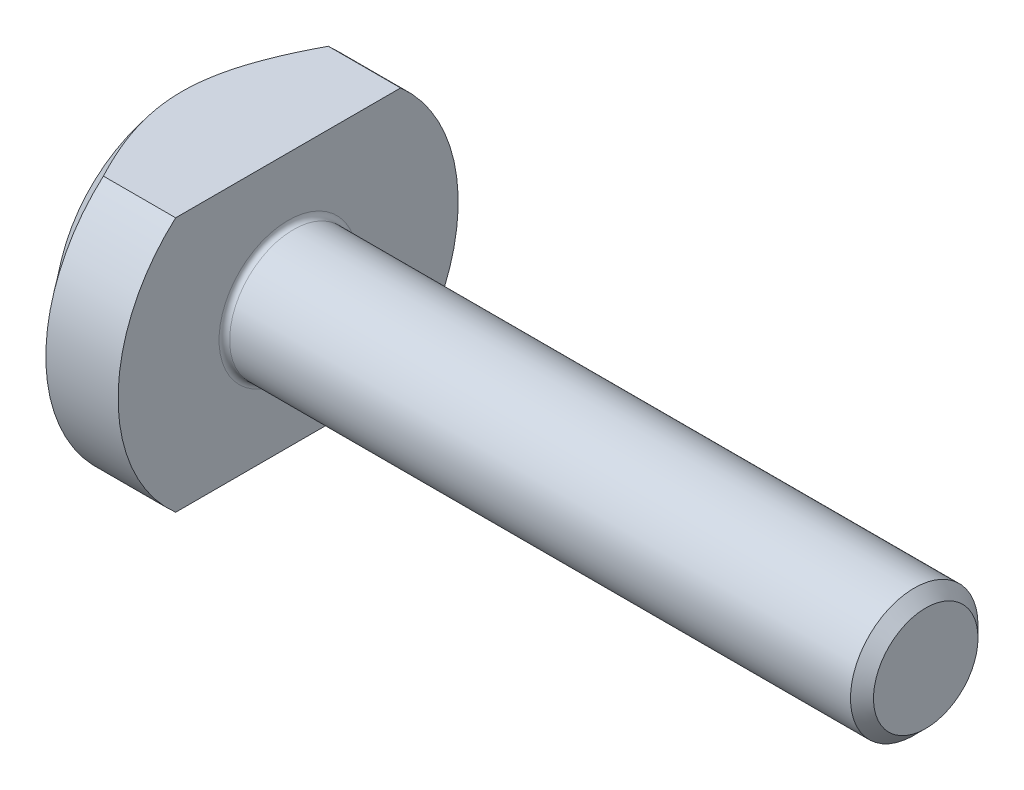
ISO-10303-21;
HEADER;
FILE_DESCRIPTION(('STEP AP214'),'2;1');
FILE_NAME('part.step','',(''),(''),'','','');
FILE_SCHEMA(('AUTOMOTIVE_DESIGN { 1 0 10303 214 1 1 1 1 }'));
ENDSEC;
DATA;
#1=APPLICATION_CONTEXT('core data for automotive mechanical design processes');
#2=APPLICATION_PROTOCOL_DEFINITION('international standard','automotive_design',2000,#1);
#3=PRODUCT_CONTEXT('',#1,'mechanical');
#4=PRODUCT('Part','Part','',(#3));
#5=PRODUCT_RELATED_PRODUCT_CATEGORY('part','',(#4));
#6=PRODUCT_DEFINITION_FORMATION('','',#4);
#7=PRODUCT_DEFINITION_CONTEXT('part definition',#1,'design');
#8=PRODUCT_DEFINITION('design','',#6,#7);
#9=PRODUCT_DEFINITION_SHAPE('','',#8);
#10=(LENGTH_UNIT() NAMED_UNIT(*) SI_UNIT(.MILLI.,.METRE.));
#11=(NAMED_UNIT(*) PLANE_ANGLE_UNIT() SI_UNIT($,.RADIAN.));
#12=(NAMED_UNIT(*) SI_UNIT($,.STERADIAN.) SOLID_ANGLE_UNIT());
#13=UNCERTAINTY_MEASURE_WITH_UNIT(LENGTH_MEASURE(1.E-05),#10,'distance_accuracy_value','');
#14=(GEOMETRIC_REPRESENTATION_CONTEXT(3) GLOBAL_UNCERTAINTY_ASSIGNED_CONTEXT((#13)) GLOBAL_UNIT_ASSIGNED_CONTEXT((#10,
#11,#12)) REPRESENTATION_CONTEXT('',''));
#15=CARTESIAN_POINT('',(0.,0.,0.));
#16=DIRECTION('',(0.,0.,1.));
#17=DIRECTION('',(1.,0.,0.));
#18=AXIS2_PLACEMENT_3D('',#15,#16,#17);
#19=CARTESIAN_POINT('',(0.,0.,0.));
#20=DIRECTION('',(1.,0.,0.));
#21=DIRECTION('',(0.,0.,-1.));
#22=AXIS2_PLACEMENT_3D('',#19,#20,#21);
#23=PLANE('',#22);
#24=CARTESIAN_POINT('',(0.,0.,0.));
#25=DIRECTION('',(1.,0.,0.));
#26=DIRECTION('',(0.,0.,-1.));
#27=AXIS2_PLACEMENT_3D('',#24,#25,#26);
#28=CIRCLE('',#27,3.25);
#29=CARTESIAN_POINT('',(0.,0.,-3.25));
#30=VERTEX_POINT('',#29);
#31=EDGE_CURVE('E153',#30,#30,#28,.F.);
#32=ORIENTED_EDGE('',*,*,#31,.T.);
#33=EDGE_LOOP('',(#32));
#34=FACE_BOUND('',#33,.T.);
#35=DIRECTION('',(0.,0.,1.));
#36=VECTOR('',#35,1.);
#37=CARTESIAN_POINT('',(0.,-6.,-5.29150262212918));
#38=LINE('',#37,#36);
#39=CARTESIAN_POINT('',(0.,-6.,-5.29150262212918));
#40=VERTEX_POINT('',#39);
#41=CARTESIAN_POINT('',(0.,-6.,5.29150262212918));
#42=VERTEX_POINT('',#41);
#43=EDGE_CURVE('E80',#40,#42,#38,.T.);
#44=ORIENTED_EDGE('',*,*,#43,.F.);
#45=CARTESIAN_POINT('',(0.,0.,0.));
#46=DIRECTION('',(-1.,0.,0.));
#47=DIRECTION('',(0.,0.,1.));
#48=AXIS2_PLACEMENT_3D('',#45,#46,#47);
#49=CIRCLE('',#48,8.);
#50=CARTESIAN_POINT('',(0.,6.,-5.29150262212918));
#51=VERTEX_POINT('',#50);
#52=EDGE_CURVE('E91',#51,#40,#49,.T.);
#53=ORIENTED_EDGE('',*,*,#52,.F.);
#54=DIRECTION('',(0.,0.,-1.));
#55=VECTOR('',#54,1.);
#56=CARTESIAN_POINT('',(0.,6.,-5.29150262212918));
#57=LINE('',#56,#55);
#58=CARTESIAN_POINT('',(0.,6.,5.29150262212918));
#59=VERTEX_POINT('',#58);
#60=EDGE_CURVE('E235',#59,#51,#57,.T.);
#61=ORIENTED_EDGE('',*,*,#60,.F.);
#62=EDGE_CURVE('E92',#42,#59,#49,.T.);
#63=ORIENTED_EDGE('',*,*,#62,.F.);
#64=EDGE_LOOP('',(#44,#53,#61,#63));
#65=FACE_BOUND('',#64,.T.);
#66=ADVANCED_FACE('F37',(#34,#65),#23,.T.);
#67=CARTESIAN_POINT('',(-7.3913010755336,0.,0.));
#68=DIRECTION('',(-1.,0.,0.));
#69=DIRECTION('',(0.,0.,1.));
#70=AXIS2_PLACEMENT_3D('',#67,#68,#69);
#71=CYLINDRICAL_SURFACE('',#70,8.);
#72=DIRECTION('',(1.,0.,0.));
#73=VECTOR('',#72,1.);
#74=CARTESIAN_POINT('',(-5.24,-6.,-5.29150262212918));
#75=LINE('',#74,#73);
#76=CARTESIAN_POINT('',(-3.4,-6.,-5.29150262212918));
#77=VERTEX_POINT('',#76);
#78=EDGE_CURVE('E77',#77,#40,#75,.T.);
#79=ORIENTED_EDGE('',*,*,#78,.F.);
#80=CARTESIAN_POINT('',(-3.4,0.,0.));
#81=DIRECTION('',(-1.,0.,0.));
#82=DIRECTION('',(0.,0.,1.));
#83=AXIS2_PLACEMENT_3D('',#80,#81,#82);
#84=CIRCLE('',#83,8.);
#85=CARTESIAN_POINT('',(-3.4,6.,-5.29150262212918));
#86=VERTEX_POINT('',#85);
#87=EDGE_CURVE('E98',#86,#77,#84,.T.);
#88=ORIENTED_EDGE('',*,*,#87,.F.);
#89=DIRECTION('',(1.,0.,0.));
#90=VECTOR('',#89,1.);
#91=CARTESIAN_POINT('',(-5.24,6.,-5.29150262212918));
#92=LINE('',#91,#90);
#93=EDGE_CURVE('E60',#86,#51,#92,.T.);
#94=ORIENTED_EDGE('',*,*,#93,.T.);
#95=ORIENTED_EDGE('',*,*,#52,.T.);
#96=EDGE_LOOP('',(#79,#88,#94,#95));
#97=FACE_BOUND('',#96,.T.);
#98=ADVANCED_FACE('F94',(#97),#71,.T.);
#99=DIRECTION('',(1.,0.,0.));
#100=VECTOR('',#99,1.);
#101=CARTESIAN_POINT('',(-5.24,-6.,5.29150262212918));
#102=LINE('',#101,#100);
#103=CARTESIAN_POINT('',(-3.4,-6.,5.29150262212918));
#104=VERTEX_POINT('',#103);
#105=EDGE_CURVE('E52',#104,#42,#102,.T.);
#106=ORIENTED_EDGE('',*,*,#105,.T.);
#107=ORIENTED_EDGE('',*,*,#62,.T.);
#108=DIRECTION('',(1.,0.,0.));
#109=VECTOR('',#108,1.);
#110=CARTESIAN_POINT('',(-5.24,6.,5.29150262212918));
#111=LINE('',#110,#109);
#112=CARTESIAN_POINT('',(-3.4,6.,5.29150262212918));
#113=VERTEX_POINT('',#112);
#114=EDGE_CURVE('E237',#113,#59,#111,.T.);
#115=ORIENTED_EDGE('',*,*,#114,.F.);
#116=EDGE_CURVE('E234',#104,#113,#84,.T.);
#117=ORIENTED_EDGE('',*,*,#116,.F.);
#118=EDGE_LOOP('',(#106,#107,#115,#117));
#119=FACE_BOUND('',#118,.T.);
#120=ADVANCED_FACE('F129',(#119),#71,.T.);
#121=CARTESIAN_POINT('',(-5.24,0.,0.));
#122=DIRECTION('',(1.,0.,0.));
#123=DIRECTION('',(0.,0.,-1.));
#124=AXIS2_PLACEMENT_3D('',#121,#122,#123);
#125=CONICAL_SURFACE('',#124,5.7,0.896055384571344);
#126=CARTESIAN_POINT('',(0.0812122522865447,-6.,-10.7962924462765));
#127=CARTESIAN_POINT('',(-0.103712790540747,-6.,-10.5317885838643));
#128=CARTESIAN_POINT('',(-0.287608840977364,-6.,-10.2665569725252));
#129=CARTESIAN_POINT('',(-0.652787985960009,-6.,-9.7342551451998));
#130=CARTESIAN_POINT('',(-0.834070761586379,-6.,-9.46718471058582));
#131=CARTESIAN_POINT('',(-1.19435262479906,-6.,-8.92949912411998));
#132=CARTESIAN_POINT('',(-1.37333505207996,-6.,-8.65887278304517));
#133=CARTESIAN_POINT('',(-1.72721903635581,-6.,-8.1149775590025));
#134=CARTESIAN_POINT('',(-1.90212078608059,-6.,-7.84170880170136));
#135=CARTESIAN_POINT('',(-2.26127215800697,-6.,-7.26876847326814));
#136=CARTESIAN_POINT('',(-2.44506841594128,-6.,-6.96881161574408));
#137=CARTESIAN_POINT('',(-2.80467537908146,-6.,-6.36405737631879));
#138=CARTESIAN_POINT('',(-2.98048486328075,-6.,-6.0592592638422));
#139=CARTESIAN_POINT('',(-3.32092753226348,-6.,-5.44430216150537));
#140=CARTESIAN_POINT('',(-3.48558379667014,-6.,-5.13415601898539));
#141=CARTESIAN_POINT('',(-3.80009577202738,-6.,-4.50645532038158));
#142=CARTESIAN_POINT('',(-3.94995698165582,-6.,-4.18890357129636));
#143=CARTESIAN_POINT('',(-4.14434586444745,-6.,-3.7403243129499));
#144=CARTESIAN_POINT('',(-4.19759942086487,-6.,-3.61306616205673));
#145=CARTESIAN_POINT('',(-4.3004539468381,-6.,-3.35709558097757));
#146=CARTESIAN_POINT('',(-4.3500553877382,-6.,-3.22838334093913));
#147=CARTESIAN_POINT('',(-4.44511852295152,-6.,-2.96943216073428));
#148=CARTESIAN_POINT('',(-4.49058029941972,-6.,-2.83919325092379));
#149=CARTESIAN_POINT('',(-4.57683375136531,-6.,-2.57712566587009));
#150=CARTESIAN_POINT('',(-4.61762337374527,-6.,-2.44529631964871));
#151=CARTESIAN_POINT('',(-4.73039488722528,-6.,-2.05331680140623));
#152=CARTESIAN_POINT('',(-4.79493769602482,-6.,-1.79092206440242));
#153=CARTESIAN_POINT('',(-4.87326205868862,-6.,-1.39379350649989));
#154=CARTESIAN_POINT('',(-4.89628744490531,-6.,-1.26083859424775));
#155=CARTESIAN_POINT('',(-4.93571247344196,-6.,-0.993956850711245));
#156=CARTESIAN_POINT('',(-4.95211322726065,-6.,-0.860030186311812));
#157=CARTESIAN_POINT('',(-4.97813018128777,-6.,-0.589213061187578));
#158=CARTESIAN_POINT('',(-4.98762602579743,-6.,-0.452310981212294));
#159=CARTESIAN_POINT('',(-4.99913128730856,-6.,-0.178208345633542));
#160=CARTESIAN_POINT('',(-5.0011417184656,-6.,-0.0410078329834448));
#161=CARTESIAN_POINT('',(-4.99762585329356,-6.,0.233297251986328));
#162=CARTESIAN_POINT('',(-4.99209948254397,-6.,0.370401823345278));
#163=CARTESIAN_POINT('',(-4.97365347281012,-6.,0.644114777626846));
#164=CARTESIAN_POINT('',(-4.96073348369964,-6.,0.780723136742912));
#165=CARTESIAN_POINT('',(-4.92747126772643,-6.,1.05595700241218));
#166=CARTESIAN_POINT('',(-4.90697806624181,-6.,1.19456418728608));
#167=CARTESIAN_POINT('',(-4.85910314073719,-6.,1.47059259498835));
#168=CARTESIAN_POINT('',(-4.83172025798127,-6.,1.60801361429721));
#169=CARTESIAN_POINT('',(-4.74010210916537,-6.,2.01813546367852));
#170=CARTESIAN_POINT('',(-4.6663911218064,-6.,2.28874355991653));
#171=CARTESIAN_POINT('',(-4.4906748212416,-6.,2.84923616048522));
#172=CARTESIAN_POINT('',(-4.38662663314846,-6.,3.13846347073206));
#173=CARTESIAN_POINT('',(-4.16011981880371,-6.,3.70971306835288));
#174=CARTESIAN_POINT('',(-4.0376495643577,-6.,3.99173067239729));
#175=CARTESIAN_POINT('',(-3.77850411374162,-6.,4.55035581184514));
#176=CARTESIAN_POINT('',(-3.64177801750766,-6.,4.82693945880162));
#177=CARTESIAN_POINT('',(-3.35798319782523,-6.,5.37462425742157));
#178=CARTESIAN_POINT('',(-3.21091687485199,-6.,5.6457266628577));
#179=CARTESIAN_POINT('',(-2.91774131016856,-6.,6.16774113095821));
#180=CARTESIAN_POINT('',(-2.77207985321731,-6.,6.41890621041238));
#181=CARTESIAN_POINT('',(-2.47526982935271,-6.,6.91798875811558));
#182=CARTESIAN_POINT('',(-2.32412083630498,-6.,7.1659059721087));
#183=CARTESIAN_POINT('',(-2.01891852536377,-6.,7.65673552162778));
#184=CARTESIAN_POINT('',(-1.86490545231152,-6.,7.89967297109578));
#185=CARTESIAN_POINT('',(-1.55344783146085,-6.,8.38325955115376));
#186=CARTESIAN_POINT('',(-1.39600410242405,-6.,8.62390920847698));
#187=CARTESIAN_POINT('',(-1.23721967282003,-6.,8.8636553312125));
#188=B_SPLINE_CURVE_WITH_KNOTS('',3,(#126,#127,#128,#129,#130,#131,#132,#133,#134,#135,#136,
#137,#138,#139,#140,#141,#142,#143,#144,#145,#146,#147,#148,#149,#150,#151,#152,#153,#154,#155,
#156,#157,#158,#159,#160,#161,#162,#163,#164,#165,#166,#167,#168,#169,#170,#171,#172,#173,#174,
#175,#176,#177,#178,#179,#180,#181,#182,#183,#184,#185,#186,#187),.UNSPECIFIED.,.F.,.F.,(4,2,2,
2,2,2,2,2,2,2,2,2,2,2,2,2,2,2,2,2,2,2,2,2,2,2,2,2,2,2,4),(0.,0.968220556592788,1.93655828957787,
2.90990422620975,3.88320409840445,4.93847831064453,5.99391331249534,7.04709297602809,
8.09987973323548,8.51368870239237,8.9274441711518,9.34119142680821,9.75511980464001,
10.5645848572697,10.9692532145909,11.37385364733,11.7853476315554,12.1967858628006,
12.6082281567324,13.0196899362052,13.4398405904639,13.8600619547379,14.7003586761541,
15.6216776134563,16.5435805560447,17.4688958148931,18.3939969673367,19.2649525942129,
20.1359760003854,20.9988742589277,21.8615687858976),.UNSPECIFIED.);
#189=EDGE_CURVE('E81',#104,#77,#188,.F.);
#190=ORIENTED_EDGE('',*,*,#189,.F.);
#191=ORIENTED_EDGE('',*,*,#116,.T.);
#192=CARTESIAN_POINT('',(0.0812122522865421,6.,-10.7962924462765));
#193=CARTESIAN_POINT('',(-0.103712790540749,6.,-10.5317885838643));
#194=CARTESIAN_POINT('',(-0.287608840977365,6.,-10.2665569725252));
#195=CARTESIAN_POINT('',(-0.652787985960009,6.,-9.7342551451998));
#196=CARTESIAN_POINT('',(-0.834070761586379,6.,-9.46718471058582));
#197=CARTESIAN_POINT('',(-1.19435262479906,6.,-8.92949912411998));
#198=CARTESIAN_POINT('',(-1.37333505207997,6.,-8.65887278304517));
#199=CARTESIAN_POINT('',(-1.72721903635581,6.,-8.11497755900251));
#200=CARTESIAN_POINT('',(-1.90212078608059,6.,-7.84170880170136));
#201=CARTESIAN_POINT('',(-2.26127215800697,6.,-7.26876847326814));
#202=CARTESIAN_POINT('',(-2.44506841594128,6.,-6.96881161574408));
#203=CARTESIAN_POINT('',(-2.80467537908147,6.,-6.3640573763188));
#204=CARTESIAN_POINT('',(-2.98048486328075,6.,-6.0592592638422));
#205=CARTESIAN_POINT('',(-3.32092753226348,6.,-5.44430216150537));
#206=CARTESIAN_POINT('',(-3.48558379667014,6.,-5.13415601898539));
#207=CARTESIAN_POINT('',(-3.80009577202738,6.,-4.50645532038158));
#208=CARTESIAN_POINT('',(-3.94995698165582,6.,-4.18890357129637));
#209=CARTESIAN_POINT('',(-4.14434586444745,6.,-3.7403243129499));
#210=CARTESIAN_POINT('',(-4.19759942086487,6.,-3.61306616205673));
#211=CARTESIAN_POINT('',(-4.3004539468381,6.,-3.35709558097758));
#212=CARTESIAN_POINT('',(-4.35005538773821,6.,-3.22838334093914));
#213=CARTESIAN_POINT('',(-4.44511852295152,6.,-2.96943216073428));
#214=CARTESIAN_POINT('',(-4.49058029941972,6.,-2.83919325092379));
#215=CARTESIAN_POINT('',(-4.57683375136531,6.,-2.5771256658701));
#216=CARTESIAN_POINT('',(-4.61762337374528,6.,-2.44529631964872));
#217=CARTESIAN_POINT('',(-4.73039488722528,6.,-2.05331680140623));
#218=CARTESIAN_POINT('',(-4.79493769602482,6.,-1.79092206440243));
#219=CARTESIAN_POINT('',(-4.87326205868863,6.,-1.39379350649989));
#220=CARTESIAN_POINT('',(-4.89628744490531,6.,-1.26083859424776));
#221=CARTESIAN_POINT('',(-4.93571247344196,6.,-0.993956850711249));
#222=CARTESIAN_POINT('',(-4.95211322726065,6.,-0.860030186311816));
#223=CARTESIAN_POINT('',(-4.97813018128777,6.,-0.589213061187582));
#224=CARTESIAN_POINT('',(-4.98762602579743,6.,-0.452310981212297));
#225=CARTESIAN_POINT('',(-4.99913128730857,6.,-0.178208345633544));
#226=CARTESIAN_POINT('',(-5.0011417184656,6.,-0.0410078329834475));
#227=CARTESIAN_POINT('',(-4.99762585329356,6.,0.233297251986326));
#228=CARTESIAN_POINT('',(-4.99209948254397,6.,0.370401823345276));
#229=CARTESIAN_POINT('',(-4.97365347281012,6.,0.644114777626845));
#230=CARTESIAN_POINT('',(-4.96073348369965,6.,0.780723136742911));
#231=CARTESIAN_POINT('',(-4.92747126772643,6.,1.05595700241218));
#232=CARTESIAN_POINT('',(-4.90697806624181,6.,1.19456418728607));
#233=CARTESIAN_POINT('',(-4.8591031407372,6.,1.47059259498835));
#234=CARTESIAN_POINT('',(-4.83172025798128,6.,1.60801361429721));
#235=CARTESIAN_POINT('',(-4.74010210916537,6.,2.01813546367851));
#236=CARTESIAN_POINT('',(-4.66639112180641,6.,2.28874355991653));
#237=CARTESIAN_POINT('',(-4.4906748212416,6.,2.84923616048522));
#238=CARTESIAN_POINT('',(-4.38662663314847,6.,3.13846347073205));
#239=CARTESIAN_POINT('',(-4.16011981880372,6.,3.70971306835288));
#240=CARTESIAN_POINT('',(-4.0376495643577,6.,3.99173067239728));
#241=CARTESIAN_POINT('',(-3.77850411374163,6.,4.55035581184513));
#242=CARTESIAN_POINT('',(-3.64177801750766,6.,4.82693945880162));
#243=CARTESIAN_POINT('',(-3.35798319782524,6.,5.37462425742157));
#244=CARTESIAN_POINT('',(-3.210916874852,6.,5.64572666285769));
#245=CARTESIAN_POINT('',(-2.91774131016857,6.,6.16774113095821));
#246=CARTESIAN_POINT('',(-2.77207985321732,6.,6.41890621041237));
#247=CARTESIAN_POINT('',(-2.47526982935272,6.,6.91798875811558));
#248=CARTESIAN_POINT('',(-2.32412083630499,6.,7.1659059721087));
#249=CARTESIAN_POINT('',(-2.01891852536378,6.,7.65673552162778));
#250=CARTESIAN_POINT('',(-1.86490545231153,6.,7.89967297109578));
#251=CARTESIAN_POINT('',(-1.55344783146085,6.,8.38325955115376));
#252=CARTESIAN_POINT('',(-1.39600410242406,6.,8.62390920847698));
#253=CARTESIAN_POINT('',(-1.23721967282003,6.,8.8636553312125));
#254=B_SPLINE_CURVE_WITH_KNOTS('',3,(#192,#193,#194,#195,#196,#197,#198,#199,#200,#201,#202,
#203,#204,#205,#206,#207,#208,#209,#210,#211,#212,#213,#214,#215,#216,#217,#218,#219,#220,#221,
#222,#223,#224,#225,#226,#227,#228,#229,#230,#231,#232,#233,#234,#235,#236,#237,#238,#239,#240,
#241,#242,#243,#244,#245,#246,#247,#248,#249,#250,#251,#252,#253),.UNSPECIFIED.,.F.,.F.,(4,2,2,
2,2,2,2,2,2,2,2,2,2,2,2,2,2,2,2,2,2,2,2,2,2,2,2,2,2,2,4),(0.,0.968220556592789,1.93655828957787,
2.90990422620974,3.88320409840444,4.93847831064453,5.99391331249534,7.04709297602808,
8.09987973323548,8.51368870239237,8.9274441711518,9.34119142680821,9.75511980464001,
10.5645848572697,10.9692532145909,11.37385364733,11.7853476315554,12.1967858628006,
12.6082281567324,13.0196899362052,13.4398405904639,13.8600619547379,14.7003586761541,
15.6216776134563,16.5435805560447,17.4688958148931,18.3939969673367,19.2649525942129,
20.1359760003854,20.9988742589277,21.8615687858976),.UNSPECIFIED.);
#255=EDGE_CURVE('E95',#86,#113,#254,.T.);
#256=ORIENTED_EDGE('',*,*,#255,.F.);
#257=ORIENTED_EDGE('',*,*,#87,.T.);
#258=EDGE_LOOP('',(#190,#191,#256,#257));
#259=FACE_BOUND('',#258,.T.);
#260=CARTESIAN_POINT('',(-5.24,0.,0.));
#261=DIRECTION('',(-1.,0.,0.));
#262=DIRECTION('',(0.,0.,1.));
#263=AXIS2_PLACEMENT_3D('',#260,#261,#262);
#264=CIRCLE('',#263,5.7);
#265=CARTESIAN_POINT('',(-5.24,0.,5.7));
#266=VERTEX_POINT('',#265);
#267=EDGE_CURVE('E241',#266,#266,#264,.T.);
#268=ORIENTED_EDGE('',*,*,#267,.F.);
#269=EDGE_LOOP('',(#268));
#270=FACE_BOUND('',#269,.T.);
#271=ADVANCED_FACE('F114',(#259,#270),#125,.T.);
#272=CARTESIAN_POINT('',(-5.24,0.,5.7));
#273=DIRECTION('',(-1.,0.,0.));
#274=DIRECTION('',(0.,0.,1.));
#275=AXIS2_PLACEMENT_3D('',#272,#273,#274);
#276=PLANE('',#275);
#277=ORIENTED_EDGE('',*,*,#267,.T.);
#278=EDGE_LOOP('',(#277));
#279=FACE_BOUND('',#278,.T.);
#280=ADVANCED_FACE('F121',(#279),#276,.T.);
#281=CARTESIAN_POINT('',(-5.24,6.,-5.29150262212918));
#282=DIRECTION('',(0.,-1.,0.));
#283=DIRECTION('',(0.,0.,-1.));
#284=AXIS2_PLACEMENT_3D('',#281,#282,#283);
#285=PLANE('',#284);
#286=ORIENTED_EDGE('',*,*,#255,.T.);
#287=ORIENTED_EDGE('',*,*,#114,.T.);
#288=ORIENTED_EDGE('',*,*,#60,.T.);
#289=ORIENTED_EDGE('',*,*,#93,.F.);
#290=EDGE_LOOP('',(#286,#287,#288,#289));
#291=FACE_BOUND('',#290,.T.);
#292=ADVANCED_FACE('F118',(#291),#285,.F.);
#293=CARTESIAN_POINT('',(-5.24,-6.,-5.29150262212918));
#294=DIRECTION('',(0.,1.,0.));
#295=DIRECTION('',(0.,0.,1.));
#296=AXIS2_PLACEMENT_3D('',#293,#294,#295);
#297=PLANE('',#296);
#298=ORIENTED_EDGE('',*,*,#189,.T.);
#299=ORIENTED_EDGE('',*,*,#78,.T.);
#300=ORIENTED_EDGE('',*,*,#43,.T.);
#301=ORIENTED_EDGE('',*,*,#105,.F.);
#302=EDGE_LOOP('',(#298,#299,#300,#301));
#303=FACE_BOUND('',#302,.T.);
#304=ADVANCED_FACE('F79',(#303),#297,.F.);
#305=CARTESIAN_POINT('',(29.9999999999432,0.,0.));
#306=DIRECTION('',(-1.,0.,0.));
#307=DIRECTION('',(0.,0.,1.));
#308=AXIS2_PLACEMENT_3D('',#305,#306,#307);
#309=CYLINDRICAL_SURFACE('',#308,3.);
#310=CARTESIAN_POINT('',(29.4584999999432,0.,0.));
#311=DIRECTION('',(1.,0.,0.));
#312=DIRECTION('',(0.,0.,-1.));
#313=AXIS2_PLACEMENT_3D('',#310,#311,#312);
#314=CIRCLE('',#313,3.);
#315=CARTESIAN_POINT('',(29.4584999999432,0.,-3.));
#316=VERTEX_POINT('',#315);
#317=EDGE_CURVE('E11',#316,#316,#314,.F.);
#318=ORIENTED_EDGE('',*,*,#317,.T.);
#319=EDGE_LOOP('',(#318));
#320=FACE_BOUND('',#319,.T.);
#321=CARTESIAN_POINT('',(0.25,0.,0.));
#322=DIRECTION('',(1.,0.,0.));
#323=DIRECTION('',(0.,0.,-1.));
#324=AXIS2_PLACEMENT_3D('',#321,#322,#323);
#325=CIRCLE('',#324,3.);
#326=CARTESIAN_POINT('',(0.25,0.,-3.));
#327=VERTEX_POINT('',#326);
#328=EDGE_CURVE('E156',#327,#327,#325,.T.);
#329=ORIENTED_EDGE('',*,*,#328,.T.);
#330=EDGE_LOOP('',(#329));
#331=FACE_BOUND('',#330,.T.);
#332=ADVANCED_FACE('F148',(#320,#331),#309,.T.);
#333=CARTESIAN_POINT('',(29.9999999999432,0.,0.));
#334=DIRECTION('',(1.,0.,0.));
#335=DIRECTION('',(0.,0.,-1.));
#336=AXIS2_PLACEMENT_3D('',#333,#334,#335);
#337=PLANE('',#336);
#338=CARTESIAN_POINT('',(29.9999999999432,0.,0.));
#339=DIRECTION('',(1.,0.,0.));
#340=DIRECTION('',(0.,0.,-1.));
#341=AXIS2_PLACEMENT_3D('',#338,#339,#340);
#342=CIRCLE('',#341,2.4585);
#343=CARTESIAN_POINT('',(29.9999999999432,0.,-2.4585));
#344=VERTEX_POINT('',#343);
#345=EDGE_CURVE('E45',#344,#344,#342,.T.);
#346=ORIENTED_EDGE('',*,*,#345,.T.);
#347=EDGE_LOOP('',(#346));
#348=FACE_BOUND('',#347,.T.);
#349=ADVANCED_FACE('F141',(#348),#337,.T.);
#350=CARTESIAN_POINT('',(0.25,0.,0.));
#351=DIRECTION('',(1.,0.,0.));
#352=DIRECTION('',(0.,0.,-1.));
#353=AXIS2_PLACEMENT_3D('',#350,#351,#352);
#354=TOROIDAL_SURFACE('',#353,3.25,0.25);
#355=ORIENTED_EDGE('',*,*,#31,.F.);
#356=EDGE_LOOP('',(#355));
#357=FACE_BOUND('',#356,.T.);
#358=ORIENTED_EDGE('',*,*,#328,.F.);
#359=EDGE_LOOP('',(#358));
#360=FACE_BOUND('',#359,.T.);
#361=ADVANCED_FACE('F139',(#357,#360),#354,.F.);
#362=CARTESIAN_POINT('',(29.9999999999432,0.,0.));
#363=DIRECTION('',(-1.,0.,0.));
#364=DIRECTION('',(0.,0.,1.));
#365=AXIS2_PLACEMENT_3D('',#362,#363,#364);
#366=CONICAL_SURFACE('',#365,2.4585,0.785398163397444);
#367=ORIENTED_EDGE('',*,*,#317,.F.);
#368=EDGE_LOOP('',(#367));
#369=FACE_BOUND('',#368,.T.);
#370=ORIENTED_EDGE('',*,*,#345,.F.);
#371=EDGE_LOOP('',(#370));
#372=FACE_BOUND('',#371,.T.);
#373=ADVANCED_FACE('F39',(#369,#372),#366,.T.);
#374=CLOSED_SHELL('',(#66,#98,#120,#271,#280,#292,#304,#332,#349,#361,#373));
#375=MANIFOLD_SOLID_BREP('B2',#374);
#376=ADVANCED_BREP_SHAPE_REPRESENTATION('',(#18,#375),#14);
#377=SHAPE_DEFINITION_REPRESENTATION(#9,#376);
ENDSEC;
END-ISO-10303-21;
